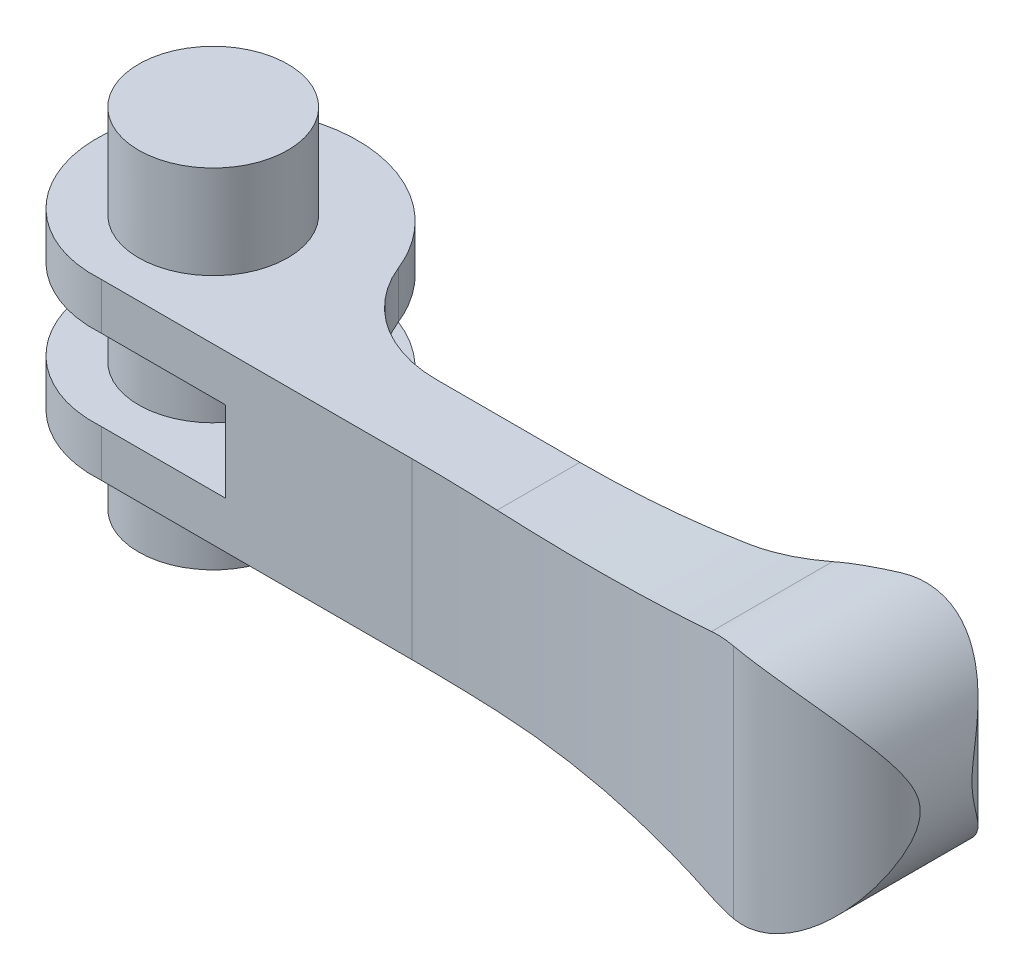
ISO-10303-21;
HEADER;
FILE_DESCRIPTION(('STEP AP214'),'2;1');
FILE_NAME('part.step','',(''),(''),'','','');
FILE_SCHEMA(('AUTOMOTIVE_DESIGN { 1 0 10303 214 1 1 1 1 }'));
ENDSEC;
DATA;
#1=APPLICATION_CONTEXT('core data for automotive mechanical design processes');
#2=APPLICATION_PROTOCOL_DEFINITION('international standard','automotive_design',2000,#1);
#3=PRODUCT_CONTEXT('',#1,'mechanical');
#4=PRODUCT('Part','Part','',(#3));
#5=PRODUCT_RELATED_PRODUCT_CATEGORY('part','',(#4));
#6=PRODUCT_DEFINITION_FORMATION('','',#4);
#7=PRODUCT_DEFINITION_CONTEXT('part definition',#1,'design');
#8=PRODUCT_DEFINITION('design','',#6,#7);
#9=PRODUCT_DEFINITION_SHAPE('','',#8);
#10=(LENGTH_UNIT() NAMED_UNIT(*) SI_UNIT(.MILLI.,.METRE.));
#11=(NAMED_UNIT(*) PLANE_ANGLE_UNIT() SI_UNIT($,.RADIAN.));
#12=(NAMED_UNIT(*) SI_UNIT($,.STERADIAN.) SOLID_ANGLE_UNIT());
#13=UNCERTAINTY_MEASURE_WITH_UNIT(LENGTH_MEASURE(1.E-05),#10,'distance_accuracy_value','');
#14=(GEOMETRIC_REPRESENTATION_CONTEXT(3) GLOBAL_UNCERTAINTY_ASSIGNED_CONTEXT((#13)) GLOBAL_UNIT_ASSIGNED_CONTEXT((#10,
#11,#12)) REPRESENTATION_CONTEXT('',''));
#15=CARTESIAN_POINT('',(0.,0.,0.));
#16=DIRECTION('',(0.,0.,1.));
#17=DIRECTION('',(1.,0.,0.));
#18=AXIS2_PLACEMENT_3D('',#15,#16,#17);
#19=CARTESIAN_POINT('',(25.,-9.5,165.511363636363));
#20=DIRECTION('',(0.,1.,0.));
#21=DIRECTION('',(1.,0.,0.));
#22=AXIS2_PLACEMENT_3D('',#19,#20,#21);
#23=CYLINDRICAL_SURFACE('',#22,156.511363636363);
#24=CARTESIAN_POINT('',(51.3201707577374,9.24653148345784,11.2289746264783));
#25=CARTESIAN_POINT('',(51.4954696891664,9.2878649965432,11.258877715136));
#26=CARTESIAN_POINT('',(51.6718456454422,9.32417702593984,11.2892762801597));
#27=CARTESIAN_POINT('',(52.0256660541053,9.38661054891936,11.3508882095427));
#28=CARTESIAN_POINT('',(52.203105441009,9.41276355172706,11.3820987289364));
#29=CARTESIAN_POINT('',(52.7374701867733,9.476153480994,11.4770445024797));
#30=CARTESIAN_POINT('',(53.0960294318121,9.49822441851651,11.5420236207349));
#31=CARTESIAN_POINT('',(53.4546518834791,9.49989176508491,11.608343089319));
#32=B_SPLINE_CURVE_WITH_KNOTS('',3,(#24,#25,#26,#27,#28,#29,#30,#31),.UNSPECIFIED.,.F.,.F.,(4,2,
2,4),(0.,0.547600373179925,1.0934884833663,2.18654613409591),.UNSPECIFIED.);
#33=CARTESIAN_POINT('',(51.3201707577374,9.24653148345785,11.2289746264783));
#34=VERTEX_POINT('',#33);
#35=CARTESIAN_POINT('',(53.4546518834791,9.49989176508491,11.6083430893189));
#36=VERTEX_POINT('',#35);
#37=EDGE_CURVE('E177',#34,#36,#32,.T.);
#38=ORIENTED_EDGE('',*,*,#37,.F.);
#39=CARTESIAN_POINT('',(32.,7.,9.15661651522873));
#40=CARTESIAN_POINT('',(32.8182704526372,6.99999719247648,9.19324583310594));
#41=CARTESIAN_POINT('',(33.6361960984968,7.01192923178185,9.23630636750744));
#42=CARTESIAN_POINT('',(35.2705716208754,7.05957160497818,9.33520563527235));
#43=CARTESIAN_POINT('',(36.0870215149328,7.09528165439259,9.39104421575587));
#44=CARTESIAN_POINT('',(38.5259507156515,7.23753055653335,9.57706397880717));
#45=CARTESIAN_POINT('',(40.1451052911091,7.37919060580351,9.72606814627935));
#46=CARTESIAN_POINT('',(43.3672677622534,7.75507082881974,10.0730278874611));
#47=CARTESIAN_POINT('',(44.9702760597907,7.98928869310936,10.2709822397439));
#48=CARTESIAN_POINT('',(47.3611114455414,8.40908803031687,10.6035220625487));
#49=CARTESIAN_POINT('',(48.1574841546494,8.56083603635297,10.7205953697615));
#50=CARTESIAN_POINT('',(49.7438041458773,8.88685979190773,10.9662394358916));
#51=CARTESIAN_POINT('',(50.5337515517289,9.06113510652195,11.0948099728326));
#52=CARTESIAN_POINT('',(51.3201707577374,9.24653148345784,11.2289746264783));
#53=B_SPLINE_CURVE_WITH_KNOTS('',3,(#39,#40,#41,#42,#43,#44,#45,#46,#47,#48,#49,#50,#51,#52),
.UNSPECIFIED.,.F.,.F.,(4,2,2,2,2,2,4),(0.,2.45704528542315,4.91406117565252,9.80682643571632,
14.699469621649,17.1564399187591,19.6133627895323),.UNSPECIFIED.);
#54=CARTESIAN_POINT('',(32.,7.,9.15661651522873));
#55=VERTEX_POINT('',#54);
#56=EDGE_CURVE('E145',#55,#34,#53,.T.);
#57=ORIENTED_EDGE('',*,*,#56,.F.);
#58=CARTESIAN_POINT('',(25.,7.,165.511363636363));
#59=DIRECTION('',(0.,1.,0.));
#60=DIRECTION('',(1.,0.,0.));
#61=AXIS2_PLACEMENT_3D('',#58,#59,#60);
#62=CIRCLE('',#61,156.511363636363);
#63=CARTESIAN_POINT('',(25.,7.,9.));
#64=VERTEX_POINT('',#63);
#65=EDGE_CURVE('E154',#64,#55,#62,.F.);
#66=ORIENTED_EDGE('',*,*,#65,.F.);
#67=DIRECTION('',(0.,1.,0.));
#68=VECTOR('',#67,1.);
#69=CARTESIAN_POINT('',(25.,-9.5,9.));
#70=LINE('',#69,#68);
#71=CARTESIAN_POINT('',(25.,-7.,9.));
#72=VERTEX_POINT('',#71);
#73=EDGE_CURVE('E303',#72,#64,#70,.T.);
#74=ORIENTED_EDGE('',*,*,#73,.F.);
#75=CARTESIAN_POINT('',(25.,-7.,165.511363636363));
#76=DIRECTION('',(0.,1.,0.));
#77=DIRECTION('',(1.,0.,0.));
#78=AXIS2_PLACEMENT_3D('',#75,#76,#77);
#79=CIRCLE('',#78,156.511363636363);
#80=CARTESIAN_POINT('',(32.,-7.,9.15661651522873));
#81=VERTEX_POINT('',#80);
#82=EDGE_CURVE('E511',#72,#81,#79,.F.);
#83=ORIENTED_EDGE('',*,*,#82,.T.);
#84=CARTESIAN_POINT('',(32.,-7.,9.15661651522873));
#85=CARTESIAN_POINT('',(32.8182704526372,-6.99999719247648,9.19324583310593));
#86=CARTESIAN_POINT('',(33.6361960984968,-7.01192923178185,9.23630636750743));
#87=CARTESIAN_POINT('',(35.2705716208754,-7.05957160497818,9.33520563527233));
#88=CARTESIAN_POINT('',(36.0870215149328,-7.09528165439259,9.39104421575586));
#89=CARTESIAN_POINT('',(38.5259507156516,-7.23753055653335,9.57706397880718));
#90=CARTESIAN_POINT('',(40.1451052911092,-7.37919060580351,9.72606814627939));
#91=CARTESIAN_POINT('',(43.3672677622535,-7.75507082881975,10.0730278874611));
#92=CARTESIAN_POINT('',(44.9702760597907,-7.98928869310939,10.2709822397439));
#93=CARTESIAN_POINT('',(47.3611114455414,-8.40908803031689,10.6035220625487));
#94=CARTESIAN_POINT('',(48.1574841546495,-8.56083603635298,10.7205953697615));
#95=CARTESIAN_POINT('',(49.7438041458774,-8.88685979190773,10.9662394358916));
#96=CARTESIAN_POINT('',(50.533751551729,-9.06113510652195,11.0948099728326));
#97=CARTESIAN_POINT('',(51.3201707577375,-9.24653148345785,11.2289746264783));
#98=B_SPLINE_CURVE_WITH_KNOTS('',3,(#84,#85,#86,#87,#88,#89,#90,#91,#92,#93,#94,#95,#96,#97),
.UNSPECIFIED.,.F.,.F.,(4,2,2,2,2,2,4),(0.,2.45704528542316,4.91406117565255,9.80682643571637,
14.699469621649,17.1564399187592,19.6133627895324),.UNSPECIFIED.);
#99=CARTESIAN_POINT('',(51.3201707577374,-9.24653148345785,11.2289746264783));
#100=VERTEX_POINT('',#99);
#101=EDGE_CURVE('E512',#81,#100,#98,.T.);
#102=ORIENTED_EDGE('',*,*,#101,.T.);
#103=CARTESIAN_POINT('',(51.3201707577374,-9.24653148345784,11.2289746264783));
#104=CARTESIAN_POINT('',(51.4954696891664,-9.2878649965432,11.258877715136));
#105=CARTESIAN_POINT('',(51.6718456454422,-9.32417702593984,11.2892762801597));
#106=CARTESIAN_POINT('',(52.0256660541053,-9.38661054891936,11.3508882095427));
#107=CARTESIAN_POINT('',(52.203105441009,-9.41276355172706,11.3820987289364));
#108=CARTESIAN_POINT('',(52.7374701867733,-9.476153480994,11.4770445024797));
#109=CARTESIAN_POINT('',(53.0960294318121,-9.49822441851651,11.5420236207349));
#110=CARTESIAN_POINT('',(53.4546518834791,-9.49989176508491,11.608343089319));
#111=B_SPLINE_CURVE_WITH_KNOTS('',3,(#103,#104,#105,#106,#107,#108,#109,#110),.UNSPECIFIED.,.F.,
.F.,(4,2,2,4),(0.,0.547600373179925,1.0934884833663,2.18654613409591),.UNSPECIFIED.);
#112=CARTESIAN_POINT('',(53.4546518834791,-9.49989176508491,11.6083430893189));
#113=VERTEX_POINT('',#112);
#114=EDGE_CURVE('E223',#100,#113,#111,.T.);
#115=ORIENTED_EDGE('',*,*,#114,.T.);
#116=DIRECTION('',(0.,1.,0.));
#117=VECTOR('',#116,1.);
#118=CARTESIAN_POINT('',(53.4546518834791,-9.5,11.6083430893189));
#119=LINE('',#118,#117);
#120=EDGE_CURVE('E286',#113,#36,#119,.T.);
#121=ORIENTED_EDGE('',*,*,#120,.T.);
#122=EDGE_LOOP('',(#38,#57,#66,#74,#83,#102,#115,#121));
#123=FACE_BOUND('',#122,.T.);
#124=ADVANCED_FACE('F14',(#123),#23,.F.);
#125=CARTESIAN_POINT('',(0.,-9.5,9.));
#126=DIRECTION('',(0.,0.,-1.));
#127=DIRECTION('',(1.,0.,0.));
#128=AXIS2_PLACEMENT_3D('',#125,#126,#127);
#129=PLANE('',#128);
#130=DIRECTION('',(1.,0.,0.));
#131=VECTOR('',#130,1.);
#132=CARTESIAN_POINT('',(0.,7.,9.));
#133=LINE('',#132,#131);
#134=CARTESIAN_POINT('',(0.,7.,9.));
#135=VERTEX_POINT('',#134);
#136=EDGE_CURVE('E165',#135,#64,#133,.T.);
#137=ORIENTED_EDGE('',*,*,#136,.F.);
#138=DIRECTION('',(0.,1.,0.));
#139=VECTOR('',#138,1.);
#140=CARTESIAN_POINT('',(0.,-9.5,9.));
#141=LINE('',#140,#139);
#142=CARTESIAN_POINT('',(0.,3.25,9.));
#143=VERTEX_POINT('',#142);
#144=EDGE_CURVE('E294',#143,#135,#141,.T.);
#145=ORIENTED_EDGE('',*,*,#144,.F.);
#146=DIRECTION('',(1.,0.,0.));
#147=VECTOR('',#146,1.);
#148=CARTESIAN_POINT('',(0.,3.25,9.));
#149=LINE('',#148,#147);
#150=CARTESIAN_POINT('',(10.,3.25,9.));
#151=VERTEX_POINT('',#150);
#152=EDGE_CURVE('E42',#143,#151,#149,.T.);
#153=ORIENTED_EDGE('',*,*,#152,.T.);
#154=DIRECTION('',(0.,-1.,0.));
#155=VECTOR('',#154,1.);
#156=CARTESIAN_POINT('',(10.,-9.5,9.));
#157=LINE('',#156,#155);
#158=CARTESIAN_POINT('',(10.,-3.25,9.));
#159=VERTEX_POINT('',#158);
#160=EDGE_CURVE('E367',#151,#159,#157,.T.);
#161=ORIENTED_EDGE('',*,*,#160,.T.);
#162=DIRECTION('',(-1.,0.,0.));
#163=VECTOR('',#162,1.);
#164=CARTESIAN_POINT('',(0.,-3.25,9.));
#165=LINE('',#164,#163);
#166=CARTESIAN_POINT('',(0.,-3.25,9.));
#167=VERTEX_POINT('',#166);
#168=EDGE_CURVE('E361',#159,#167,#165,.T.);
#169=ORIENTED_EDGE('',*,*,#168,.T.);
#170=CARTESIAN_POINT('',(0.,-7.,9.));
#171=VERTEX_POINT('',#170);
#172=EDGE_CURVE('E298',#171,#167,#141,.T.);
#173=ORIENTED_EDGE('',*,*,#172,.F.);
#174=DIRECTION('',(1.,0.,0.));
#175=VECTOR('',#174,1.);
#176=CARTESIAN_POINT('',(0.,-7.,9.));
#177=LINE('',#176,#175);
#178=EDGE_CURVE('E514',#171,#72,#177,.T.);
#179=ORIENTED_EDGE('',*,*,#178,.T.);
#180=ORIENTED_EDGE('',*,*,#73,.T.);
#181=EDGE_LOOP('',(#137,#145,#153,#161,#169,#173,#179,#180));
#182=FACE_BOUND('',#181,.T.);
#183=ADVANCED_FACE('F274',(#182),#129,.F.);
#184=CARTESIAN_POINT('',(0.,-9.5,9.));
#185=CARTESIAN_POINT('',(-1.17809724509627,-9.5,9.082375));
#186=CARTESIAN_POINT('',(-2.38889185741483,-9.5,8.93034251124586));
#187=CARTESIAN_POINT('',(-4.68855121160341,-9.5,8.15611653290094));
#188=CARTESIAN_POINT('',(-5.77641227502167,-9.5,7.53398899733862));
#189=CARTESIAN_POINT('',(-7.65048483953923,-9.5,5.892908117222));
#190=CARTESIAN_POINT('',(-8.43577630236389,-9.5,4.87441779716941));
#191=CARTESIAN_POINT('',(-9.56393765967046,-9.5,2.58130784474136));
#192=CARTESIAN_POINT('',(-9.906125,-9.5,1.3074915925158));
#193=CARTESIAN_POINT('',(-10.070875,-9.5,-1.30749159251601));
#194=CARTESIAN_POINT('',(-9.89311450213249,-9.5,-2.64762964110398));
#195=CARTESIAN_POINT('',(-9.01985437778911,-9.5,-5.18637857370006));
#196=CARTESIAN_POINT('',(-8.32445967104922,-9.5,-6.38389170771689));
#197=CARTESIAN_POINT('',(-6.50038754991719,-9.5,-8.44095551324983));
#198=CARTESIAN_POINT('',(-5.37224515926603,-9.5,-9.29951414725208));
#199=CARTESIAN_POINT('',(-2.8400456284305,-9.5,-10.5267096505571));
#200=CARTESIAN_POINT('',(-1.43688593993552,-9.5,-10.894625));
#201=CARTESIAN_POINT('',(1.43688593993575,-9.5,-11.059375));
#202=CARTESIAN_POINT('',(2.90636742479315,-9.5,-10.8558864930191));
#203=CARTESIAN_POINT('',(5.6842059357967,-9.5,-9.88359222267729));
#204=CARTESIAN_POINT('',(6.9913711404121,-9.5,-9.11493034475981));
#205=CARTESIAN_POINT('',(9.23142618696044,-9.5,-7.10786698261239));
#206=CARTESIAN_POINT('',(10.1632519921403,-9.5,-5.87007252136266));
#207=CARTESIAN_POINT('',(11.4894816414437,-9.5,-3.09878341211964));
#208=CARTESIAN_POINT('',(11.883125,-9.5,-1.56628028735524));
#209=CARTESIAN_POINT('',(12.047875,-9.5,1.56628028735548));
#210=CARTESIAN_POINT('',(11.8186584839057,-9.5,3.16510520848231));
#211=CARTESIAN_POINT('',(10.7473300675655,-9.5,6.18203329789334));
#212=CARTESIAN_POINT('',(9.9054010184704,-9.5,7.59885057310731));
#213=CARTESIAN_POINT('',(7.71534641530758,-9.5,10.021896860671));
#214=CARTESIAN_POINT('',(6.36789988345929,-9.5,11.0269898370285));
#215=CARTESIAN_POINT('',(3.35752119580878,-9.5,12.4522536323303));
#216=CARTESIAN_POINT('',(1.69567463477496,-9.5,12.871625));
#217=CARTESIAN_POINT('',(-1.32513132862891E-13,-9.5,12.954));
#218=B_SPLINE_CURVE_WITH_KNOTS('',3,(#184,#185,#186,#187,#188,#189,#190,#191,#192,#193,#194,
#195,#196,#197,#198,#199,#200,#201,#202,#203,#204,#205,#206,#207,#208,#209,#210,#211,#212,#213,
#214,#215,#216,#217),.UNSPECIFIED.,.F.,.F.,(4,2,2,2,2,2,2,2,2,2,2,2,2,2,2,2,4),(0.,0.0625,0.125,
0.1875,0.25,0.3125,0.375,0.4375,0.5,0.5625,0.625,0.6875,0.75,0.8125,0.875,0.9375,1.),.UNSPECIFIED.);
#219=DIRECTION('',(0.,1.,0.));
#220=VECTOR('',#219,1.);
#221=SURFACE_OF_LINEAR_EXTRUSION('',#218,#220);
#222=CARTESIAN_POINT('',(0.,7.,9.));
#223=CARTESIAN_POINT('',(-1.17809724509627,7.,9.082375));
#224=CARTESIAN_POINT('',(-2.38889185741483,7.,8.93034251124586));
#225=CARTESIAN_POINT('',(-4.68855121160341,7.,8.15611653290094));
#226=CARTESIAN_POINT('',(-5.77641227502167,7.,7.53398899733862));
#227=CARTESIAN_POINT('',(-7.65048483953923,7.,5.892908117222));
#228=CARTESIAN_POINT('',(-8.43577630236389,7.,4.87441779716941));
#229=CARTESIAN_POINT('',(-9.56393765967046,7.,2.58130784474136));
#230=CARTESIAN_POINT('',(-9.906125,7.,1.3074915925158));
#231=CARTESIAN_POINT('',(-10.070875,7.,-1.30749159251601));
#232=CARTESIAN_POINT('',(-9.89311450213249,7.,-2.64762964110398));
#233=CARTESIAN_POINT('',(-9.01985437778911,7.,-5.18637857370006));
#234=CARTESIAN_POINT('',(-8.32445967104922,7.,-6.38389170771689));
#235=CARTESIAN_POINT('',(-6.50038754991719,7.,-8.44095551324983));
#236=CARTESIAN_POINT('',(-5.37224515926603,7.,-9.29951414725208));
#237=CARTESIAN_POINT('',(-2.8400456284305,7.,-10.5267096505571));
#238=CARTESIAN_POINT('',(-1.43688593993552,7.,-10.894625));
#239=CARTESIAN_POINT('',(1.43688593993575,7.,-11.059375));
#240=CARTESIAN_POINT('',(2.90636742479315,7.,-10.8558864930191));
#241=CARTESIAN_POINT('',(5.6842059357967,7.,-9.88359222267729));
#242=CARTESIAN_POINT('',(6.9913711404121,7.,-9.11493034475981));
#243=CARTESIAN_POINT('',(9.23142618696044,7.,-7.10786698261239));
#244=CARTESIAN_POINT('',(10.1632519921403,7.,-5.87007252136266));
#245=CARTESIAN_POINT('',(11.4894816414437,7.,-3.09878341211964));
#246=CARTESIAN_POINT('',(11.883125,7.,-1.56628028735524));
#247=CARTESIAN_POINT('',(12.047875,7.,1.56628028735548));
#248=CARTESIAN_POINT('',(11.8186584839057,7.,3.16510520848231));
#249=CARTESIAN_POINT('',(10.7473300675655,7.,6.18203329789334));
#250=CARTESIAN_POINT('',(9.9054010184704,7.,7.59885057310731));
#251=CARTESIAN_POINT('',(7.71534641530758,7.,10.021896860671));
#252=CARTESIAN_POINT('',(6.36789988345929,7.,11.0269898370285));
#253=CARTESIAN_POINT('',(3.35752119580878,7.,12.4522536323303));
#254=CARTESIAN_POINT('',(1.69567463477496,7.,12.871625));
#255=CARTESIAN_POINT('',(-1.32513132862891E-13,7.,12.954));
#256=B_SPLINE_CURVE_WITH_KNOTS('',3,(#222,#223,#224,#225,#226,#227,#228,#229,#230,#231,#232,
#233,#234,#235,#236,#237,#238,#239,#240,#241,#242,#243,#244,#245,#246,#247,#248,#249,#250,#251,
#252,#253,#254,#255),.UNSPECIFIED.,.F.,.F.,(4,2,2,2,2,2,2,2,2,2,2,2,2,2,2,2,4),(0.,0.0625,0.125,
0.1875,0.25,0.3125,0.375,0.4375,0.5,0.5625,0.625,0.6875,0.75,0.8125,0.875,0.9375,1.),.UNSPECIFIED.);
#257=CARTESIAN_POINT('',(11.1333903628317,7.,-3.78460278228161));
#258=VERTEX_POINT('',#257);
#259=EDGE_CURVE('E163',#258,#135,#256,.F.);
#260=ORIENTED_EDGE('',*,*,#259,.F.);
#261=DIRECTION('',(0.,1.,0.));
#262=VECTOR('',#261,1.);
#263=CARTESIAN_POINT('',(11.1333903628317,9.5,-3.78460278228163));
#264=LINE('',#263,#262);
#265=CARTESIAN_POINT('',(11.1333903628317,3.25,-3.78460278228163));
#266=VERTEX_POINT('',#265);
#267=EDGE_CURVE('E35',#258,#266,#264,.F.);
#268=ORIENTED_EDGE('',*,*,#267,.T.);
#269=CARTESIAN_POINT('',(0.,3.25,9.));
#270=CARTESIAN_POINT('',(-1.17809724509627,3.25,9.082375));
#271=CARTESIAN_POINT('',(-2.38889185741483,3.25,8.93034251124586));
#272=CARTESIAN_POINT('',(-4.68855121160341,3.25,8.15611653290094));
#273=CARTESIAN_POINT('',(-5.77641227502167,3.25,7.53398899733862));
#274=CARTESIAN_POINT('',(-7.65048483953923,3.25,5.892908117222));
#275=CARTESIAN_POINT('',(-8.43577630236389,3.25,4.87441779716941));
#276=CARTESIAN_POINT('',(-9.56393765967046,3.25,2.58130784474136));
#277=CARTESIAN_POINT('',(-9.906125,3.25,1.3074915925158));
#278=CARTESIAN_POINT('',(-10.070875,3.25,-1.30749159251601));
#279=CARTESIAN_POINT('',(-9.89311450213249,3.25,-2.64762964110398));
#280=CARTESIAN_POINT('',(-9.01985437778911,3.25,-5.18637857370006));
#281=CARTESIAN_POINT('',(-8.32445967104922,3.25,-6.38389170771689));
#282=CARTESIAN_POINT('',(-6.50038754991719,3.25,-8.44095551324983));
#283=CARTESIAN_POINT('',(-5.37224515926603,3.25,-9.29951414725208));
#284=CARTESIAN_POINT('',(-2.8400456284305,3.25,-10.5267096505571));
#285=CARTESIAN_POINT('',(-1.43688593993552,3.25,-10.894625));
#286=CARTESIAN_POINT('',(1.43688593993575,3.25,-11.059375));
#287=CARTESIAN_POINT('',(2.90636742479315,3.25,-10.8558864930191));
#288=CARTESIAN_POINT('',(5.6842059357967,3.25,-9.88359222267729));
#289=CARTESIAN_POINT('',(6.9913711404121,3.25,-9.11493034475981));
#290=CARTESIAN_POINT('',(9.23142618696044,3.25,-7.10786698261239));
#291=CARTESIAN_POINT('',(10.1632519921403,3.25,-5.87007252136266));
#292=CARTESIAN_POINT('',(11.4894816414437,3.25,-3.09878341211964));
#293=CARTESIAN_POINT('',(11.883125,3.25,-1.56628028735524));
#294=CARTESIAN_POINT('',(12.047875,3.25,1.56628028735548));
#295=CARTESIAN_POINT('',(11.8186584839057,3.25,3.16510520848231));
#296=CARTESIAN_POINT('',(10.7473300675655,3.25,6.18203329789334));
#297=CARTESIAN_POINT('',(9.9054010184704,3.25,7.59885057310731));
#298=CARTESIAN_POINT('',(7.71534641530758,3.25,10.021896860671));
#299=CARTESIAN_POINT('',(6.36789988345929,3.25,11.0269898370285));
#300=CARTESIAN_POINT('',(3.35752119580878,3.25,12.4522536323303));
#301=CARTESIAN_POINT('',(1.69567463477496,3.25,12.871625));
#302=CARTESIAN_POINT('',(-1.32513132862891E-13,3.25,12.954));
#303=B_SPLINE_CURVE_WITH_KNOTS('',3,(#269,#270,#271,#272,#273,#274,#275,#276,#277,#278,#279,
#280,#281,#282,#283,#284,#285,#286,#287,#288,#289,#290,#291,#292,#293,#294,#295,#296,#297,#298,
#299,#300,#301,#302),.UNSPECIFIED.,.F.,.F.,(4,2,2,2,2,2,2,2,2,2,2,2,2,2,2,2,4),(0.,0.0625,0.125,
0.1875,0.25,0.3125,0.375,0.4375,0.5,0.5625,0.625,0.6875,0.75,0.8125,0.875,0.9375,1.),.UNSPECIFIED.);
#304=EDGE_CURVE('E309',#266,#143,#303,.F.);
#305=ORIENTED_EDGE('',*,*,#304,.T.);
#306=ORIENTED_EDGE('',*,*,#144,.T.);
#307=EDGE_LOOP('',(#260,#268,#305,#306));
#308=FACE_BOUND('',#307,.T.);
#309=ADVANCED_FACE('F280',(#308),#221,.F.);
#310=CARTESIAN_POINT('',(11.8345872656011,-9.5,2.5));
#311=DIRECTION('',(0.,0.,1.));
#312=DIRECTION('',(-1.,0.,0.));
#313=AXIS2_PLACEMENT_3D('',#310,#311,#312);
#314=PLANE('',#313);
#315=CARTESIAN_POINT('',(32.,91.2,2.5));
#316=DIRECTION('',(0.,0.,1.));
#317=DIRECTION('',(-1.,0.,0.));
#318=AXIS2_PLACEMENT_3D('',#315,#316,#317);
#319=CIRCLE('',#318,84.2);
#320=CARTESIAN_POINT('',(45.5626570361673,8.09949257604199,2.5));
#321=VERTEX_POINT('',#320);
#322=CARTESIAN_POINT('',(32.,7.,2.5));
#323=VERTEX_POINT('',#322);
#324=EDGE_CURVE('E134',#321,#323,#319,.F.);
#325=ORIENTED_EDGE('',*,*,#324,.F.);
#326=DIRECTION('',(0.,1.,0.));
#327=VECTOR('',#326,1.);
#328=CARTESIAN_POINT('',(45.5626570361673,-9.5,2.5));
#329=LINE('',#328,#327);
#330=CARTESIAN_POINT('',(45.5626570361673,-8.09949257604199,2.5));
#331=VERTEX_POINT('',#330);
#332=EDGE_CURVE('E290',#331,#321,#329,.T.);
#333=ORIENTED_EDGE('',*,*,#332,.F.);
#334=CARTESIAN_POINT('',(32.,-91.2,2.5));
#335=DIRECTION('',(0.,0.,1.));
#336=DIRECTION('',(-1.,0.,0.));
#337=AXIS2_PLACEMENT_3D('',#334,#335,#336);
#338=CIRCLE('',#337,84.2);
#339=CARTESIAN_POINT('',(32.,-7.,2.5));
#340=VERTEX_POINT('',#339);
#341=EDGE_CURVE('E258',#331,#340,#338,.T.);
#342=ORIENTED_EDGE('',*,*,#341,.T.);
#343=DIRECTION('',(-1.,0.,0.));
#344=VECTOR('',#343,1.);
#345=CARTESIAN_POINT('',(11.8345872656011,-7.,2.5));
#346=LINE('',#345,#344);
#347=CARTESIAN_POINT('',(20.417560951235,-7.,2.5));
#348=VERTEX_POINT('',#347);
#349=EDGE_CURVE('E330',#340,#348,#346,.T.);
#350=ORIENTED_EDGE('',*,*,#349,.T.);
#351=DIRECTION('',(0.,-1.,0.));
#352=VECTOR('',#351,1.);
#353=CARTESIAN_POINT('',(20.417560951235,9.5,2.5));
#354=LINE('',#353,#352);
#355=CARTESIAN_POINT('',(20.417560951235,-3.25,2.5));
#356=VERTEX_POINT('',#355);
#357=EDGE_CURVE('E315',#348,#356,#354,.F.);
#358=ORIENTED_EDGE('',*,*,#357,.T.);
#359=DIRECTION('',(-1.,0.,0.));
#360=VECTOR('',#359,1.);
#361=CARTESIAN_POINT('',(28.,-3.25,2.5));
#362=LINE('',#361,#360);
#363=CARTESIAN_POINT('',(10.,-3.25,2.5));
#364=VERTEX_POINT('',#363);
#365=EDGE_CURVE('E341',#356,#364,#362,.T.);
#366=ORIENTED_EDGE('',*,*,#365,.T.);
#367=DIRECTION('',(0.,1.,0.));
#368=VECTOR('',#367,1.);
#369=CARTESIAN_POINT('',(10.,-3.25,2.5));
#370=LINE('',#369,#368);
#371=CARTESIAN_POINT('',(10.,3.25,2.5));
#372=VERTEX_POINT('',#371);
#373=EDGE_CURVE('E339',#364,#372,#370,.T.);
#374=ORIENTED_EDGE('',*,*,#373,.T.);
#375=DIRECTION('',(-1.,0.,0.));
#376=VECTOR('',#375,1.);
#377=CARTESIAN_POINT('',(28.,3.25,2.5));
#378=LINE('',#377,#376);
#379=CARTESIAN_POINT('',(20.417560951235,3.25,2.5));
#380=VERTEX_POINT('',#379);
#381=EDGE_CURVE('E336',#380,#372,#378,.T.);
#382=ORIENTED_EDGE('',*,*,#381,.F.);
#383=CARTESIAN_POINT('',(20.417560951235,7.,2.50000000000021));
#384=VERTEX_POINT('',#383);
#385=EDGE_CURVE('E162',#380,#384,#354,.F.);
#386=ORIENTED_EDGE('',*,*,#385,.T.);
#387=DIRECTION('',(-1.,0.,0.));
#388=VECTOR('',#387,1.);
#389=CARTESIAN_POINT('',(11.8345872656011,7.,2.5));
#390=LINE('',#389,#388);
#391=EDGE_CURVE('E151',#323,#384,#390,.T.);
#392=ORIENTED_EDGE('',*,*,#391,.F.);
#393=EDGE_LOOP('',(#325,#333,#342,#350,#358,#366,#374,#382,#386,#392));
#394=FACE_BOUND('',#393,.T.);
#395=ADVANCED_FACE('F159',(#394),#314,.F.);
#396=CARTESIAN_POINT('',(45.5626570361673,-9.5,-14.5));
#397=DIRECTION('',(0.,1.,0.));
#398=DIRECTION('',(1.,0.,0.));
#399=AXIS2_PLACEMENT_3D('',#396,#397,#398);
#400=CYLINDRICAL_SURFACE('',#399,17.);
#401=CARTESIAN_POINT('',(54.9597606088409,9.38717736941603,-0.333333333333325));
#402=CARTESIAN_POINT('',(54.7316206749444,9.42267662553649,-0.181950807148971));
#403=CARTESIAN_POINT('',(54.498837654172,9.45033434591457,-0.0355271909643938));
#404=CARTESIAN_POINT('',(54.0250539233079,9.48845532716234,0.246646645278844));
#405=CARTESIAN_POINT('',(53.7840411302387,9.49889208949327,0.382380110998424));
#406=CARTESIAN_POINT('',(53.3000815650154,9.5009221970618,0.639552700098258));
#407=CARTESIAN_POINT('',(53.0572524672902,9.49285956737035,0.761209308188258));
#408=CARTESIAN_POINT('',(52.5674007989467,9.45729667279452,0.992150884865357));
#409=CARTESIAN_POINT('',(52.3203826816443,9.42981592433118,1.10144814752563));
#410=CARTESIAN_POINT('',(51.9475951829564,9.37315159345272,1.2559775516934));
#411=CARTESIAN_POINT('',(51.8226148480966,9.35161024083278,1.306040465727));
#412=CARTESIAN_POINT('',(51.5718111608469,9.30314348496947,1.40308902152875));
#413=CARTESIAN_POINT('',(51.4459865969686,9.27619341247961,1.45005920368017));
#414=CARTESIAN_POINT('',(51.3201707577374,9.24653148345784,1.49534418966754));
#415=B_SPLINE_CURVE_WITH_KNOTS('',3,(#401,#402,#403,#404,#405,#406,#407,#408,#409,#410,#411,
#412,#413,#414),.UNSPECIFIED.,.F.,.F.,(4,2,2,2,2,2,4),(0.,0.828239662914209,1.65775258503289,
2.47196473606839,3.28535971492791,3.6942751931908,4.10509995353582),.UNSPECIFIED.);
#416=CARTESIAN_POINT('',(54.9597606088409,9.38717736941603,-0.333333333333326));
#417=VERTEX_POINT('',#416);
#418=CARTESIAN_POINT('',(51.3201707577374,9.24653148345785,1.49534418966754));
#419=VERTEX_POINT('',#418);
#420=EDGE_CURVE('E146',#417,#419,#415,.T.);
#421=ORIENTED_EDGE('',*,*,#420,.F.);
#422=DIRECTION('',(0.,1.,0.));
#423=VECTOR('',#422,1.);
#424=CARTESIAN_POINT('',(54.9597606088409,-9.5,-0.333333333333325));
#425=LINE('',#424,#423);
#426=CARTESIAN_POINT('',(54.9597606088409,-9.38717736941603,-0.333333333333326));
#427=VERTEX_POINT('',#426);
#428=EDGE_CURVE('E295',#427,#417,#425,.T.);
#429=ORIENTED_EDGE('',*,*,#428,.F.);
#430=CARTESIAN_POINT('',(54.9597606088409,-9.38717736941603,-0.333333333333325));
#431=CARTESIAN_POINT('',(54.7316206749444,-9.42267662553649,-0.181950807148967));
#432=CARTESIAN_POINT('',(54.498837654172,-9.45033434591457,-0.0355271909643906));
#433=CARTESIAN_POINT('',(54.0250539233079,-9.48845532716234,0.246646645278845));
#434=CARTESIAN_POINT('',(53.7840411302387,-9.49889208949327,0.382380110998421));
#435=CARTESIAN_POINT('',(53.3000815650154,-9.5009221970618,0.639552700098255));
#436=CARTESIAN_POINT('',(53.0572524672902,-9.49285956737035,0.761209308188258));
#437=CARTESIAN_POINT('',(52.5674007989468,-9.45729667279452,0.992150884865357));
#438=CARTESIAN_POINT('',(52.3203826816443,-9.42981592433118,1.10144814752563));
#439=CARTESIAN_POINT('',(51.9475951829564,-9.37315159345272,1.2559775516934));
#440=CARTESIAN_POINT('',(51.8226148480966,-9.35161024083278,1.306040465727));
#441=CARTESIAN_POINT('',(51.5718111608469,-9.30314348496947,1.40308902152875));
#442=CARTESIAN_POINT('',(51.4459865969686,-9.27619341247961,1.45005920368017));
#443=CARTESIAN_POINT('',(51.3201707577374,-9.24653148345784,1.49534418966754));
#444=B_SPLINE_CURVE_WITH_KNOTS('',3,(#430,#431,#432,#433,#434,#435,#436,#437,#438,#439,#440,
#441,#442,#443),.UNSPECIFIED.,.F.,.F.,(4,2,2,2,2,2,4),(0.,0.82823966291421,1.65775258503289,
2.47196473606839,3.28535971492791,3.6942751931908,4.10509995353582),.UNSPECIFIED.);
#445=CARTESIAN_POINT('',(51.3201707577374,-9.24653148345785,1.49534418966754));
#446=VERTEX_POINT('',#445);
#447=EDGE_CURVE('E224',#427,#446,#444,.T.);
#448=ORIENTED_EDGE('',*,*,#447,.T.);
#449=CARTESIAN_POINT('',(51.3201707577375,-9.24653148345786,1.49534418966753));
#450=CARTESIAN_POINT('',(50.8603357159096,-9.13808848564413,1.66090351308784));
#451=CARTESIAN_POINT('',(50.3928479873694,-9.03200341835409,1.80673339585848));
#452=CARTESIAN_POINT('',(49.4492987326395,-8.82651076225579,2.05687636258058));
#453=CARTESIAN_POINT('',(48.9733251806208,-8.72705992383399,2.16148595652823));
#454=CARTESIAN_POINT('',(48.0126814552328,-8.53516921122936,2.32959170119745));
#455=CARTESIAN_POINT('',(47.5280109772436,-8.44272958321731,2.39308640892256));
#456=CARTESIAN_POINT('',(46.7955018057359,-8.30973871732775,2.45702873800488));
#457=CARTESIAN_POINT('',(46.5494786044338,-8.26620019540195,2.4731270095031));
#458=CARTESIAN_POINT('',(46.0565939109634,-8.18123846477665,2.49461289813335));
#459=CARTESIAN_POINT('',(45.8097323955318,-8.13981531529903,2.500000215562));
#460=CARTESIAN_POINT('',(45.5626570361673,-8.09949257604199,2.5));
#461=B_SPLINE_CURVE_WITH_KNOTS('',3,(#449,#450,#451,#452,#453,#454,#455,#456,#457,#458,#459,
#460),.UNSPECIFIED.,.F.,.F.,(4,2,2,2,2,4),(0.,1.5013779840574,2.99174983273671,4.48217398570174,
5.23305850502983,5.98396403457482),.UNSPECIFIED.);
#462=EDGE_CURVE('E292',#446,#331,#461,.T.);
#463=ORIENTED_EDGE('',*,*,#462,.T.);
#464=ORIENTED_EDGE('',*,*,#332,.T.);
#465=CARTESIAN_POINT('',(51.3201707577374,9.24653148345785,1.49534418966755));
#466=CARTESIAN_POINT('',(50.8603357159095,9.13808848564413,1.66090351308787));
#467=CARTESIAN_POINT('',(50.3928479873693,9.03200341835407,1.8067333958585));
#468=CARTESIAN_POINT('',(49.4492987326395,8.82651076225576,2.0568763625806));
#469=CARTESIAN_POINT('',(48.9733251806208,8.72705992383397,2.16148595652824));
#470=CARTESIAN_POINT('',(48.0126814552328,8.53516921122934,2.32959170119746));
#471=CARTESIAN_POINT('',(47.5280109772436,8.44272958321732,2.39308640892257));
#472=CARTESIAN_POINT('',(46.7955018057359,8.30973871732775,2.45702873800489));
#473=CARTESIAN_POINT('',(46.5494786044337,8.26620019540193,2.4731270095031));
#474=CARTESIAN_POINT('',(46.0565939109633,8.18123846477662,2.49461289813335));
#475=CARTESIAN_POINT('',(45.8097323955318,8.13981531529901,2.50000021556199));
#476=CARTESIAN_POINT('',(45.5626570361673,8.09949257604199,2.5));
#477=B_SPLINE_CURVE_WITH_KNOTS('',3,(#465,#466,#467,#468,#469,#470,#471,#472,#473,#474,#475,
#476),.UNSPECIFIED.,.F.,.F.,(4,2,2,2,2,4),(0.,1.50137798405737,2.99174983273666,
4.48217398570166,5.23305850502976,5.98396403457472),.UNSPECIFIED.);
#478=EDGE_CURVE('E9',#419,#321,#477,.T.);
#479=ORIENTED_EDGE('',*,*,#478,.F.);
#480=EDGE_LOOP('',(#421,#429,#448,#463,#464,#479));
#481=FACE_BOUND('',#480,.T.);
#482=ADVANCED_FACE('F188',(#481),#400,.F.);
#483=CARTESIAN_POINT('',(58.,-9.5,4.25));
#484=DIRECTION('',(0.,1.,0.));
#485=DIRECTION('',(1.,0.,0.));
#486=AXIS2_PLACEMENT_3D('',#483,#484,#485);
#487=CYLINDRICAL_SURFACE('',#486,5.5);
#488=ORIENTED_EDGE('',*,*,#428,.T.);
#489=CARTESIAN_POINT('',(54.9597606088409,9.38717736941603,-0.333333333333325));
#490=CARTESIAN_POINT('',(55.0773672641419,9.36890920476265,-0.411379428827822));
#491=CARTESIAN_POINT('',(55.1977181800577,9.34791104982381,-0.484658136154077));
#492=CARTESIAN_POINT('',(55.4427584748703,9.30006282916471,-0.621356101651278));
#493=CARTESIAN_POINT('',(55.5674473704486,9.27321341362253,-0.684776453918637));
#494=CARTESIAN_POINT('',(55.8194893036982,9.21339759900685,-0.801196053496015));
#495=CARTESIAN_POINT('',(55.9468283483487,9.18045839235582,-0.854239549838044));
#496=CARTESIAN_POINT('',(56.2035022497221,9.10817454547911,-0.95013066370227));
#497=CARTESIAN_POINT('',(56.3328370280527,9.06883015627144,-0.992978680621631));
#498=CARTESIAN_POINT('',(56.5923414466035,8.98365610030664,-1.06853033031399));
#499=CARTESIAN_POINT('',(56.7225111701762,8.93782577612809,-1.10123293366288));
#500=CARTESIAN_POINT('',(56.9825914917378,8.83973306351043,-1.15671511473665));
#501=CARTESIAN_POINT('',(57.1125019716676,8.78746822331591,-1.17949089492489));
#502=CARTESIAN_POINT('',(57.3709755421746,8.67671123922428,-1.21546938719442));
#503=CARTESIAN_POINT('',(57.4995386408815,8.61821913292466,-1.22867215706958));
#504=CARTESIAN_POINT('',(57.7544514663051,8.49527400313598,-1.24600183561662));
#505=CARTESIAN_POINT('',(57.8808003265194,8.43081870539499,-1.2501252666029));
#506=CARTESIAN_POINT('',(58.1354029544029,8.29365764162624,-1.24986389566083));
#507=CARTESIAN_POINT('',(58.2635348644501,8.22072656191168,-1.24513662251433));
#508=CARTESIAN_POINT('',(58.5158521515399,8.06925777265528,-1.22721754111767));
#509=CARTESIAN_POINT('',(58.6400360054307,7.99071793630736,-1.21402250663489));
#510=CARTESIAN_POINT('',(59.0058665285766,7.74732609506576,-1.16283883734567));
#511=CARTESIAN_POINT('',(59.2408364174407,7.57467783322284,-1.11325109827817));
#512=CARTESIAN_POINT('',(59.6405049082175,7.25224475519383,-1.00279535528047));
#513=CARTESIAN_POINT('',(59.8093120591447,7.10575174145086,-0.946787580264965));
#514=CARTESIAN_POINT('',(60.1338203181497,6.80378902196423,-0.822180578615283));
#515=CARTESIAN_POINT('',(60.289515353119,6.64831521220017,-0.753575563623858));
#516=CARTESIAN_POINT('',(60.7371745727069,6.16963779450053,-0.532140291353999));
#517=CARTESIAN_POINT('',(61.0091468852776,5.83464136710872,-0.363861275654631));
#518=CARTESIAN_POINT('',(61.4235163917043,5.24914542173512,-0.0596940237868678));
#519=CARTESIAN_POINT('',(61.579867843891,5.00488750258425,0.0699222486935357));
#520=CARTESIAN_POINT('',(61.8685709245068,4.5055731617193,0.335588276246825));
#521=CARTESIAN_POINT('',(62.0009048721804,4.25050895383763,0.471642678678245));
#522=CARTESIAN_POINT('',(62.2419737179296,3.72966259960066,0.744474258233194));
#523=CARTESIAN_POINT('',(62.3506994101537,3.46387631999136,0.881251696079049));
#524=CARTESIAN_POINT('',(62.4960478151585,3.05644242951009,1.0810294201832));
#525=CARTESIAN_POINT('',(62.5415283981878,2.9192192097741,1.14670294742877));
#526=CARTESIAN_POINT('',(62.6265277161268,2.64151248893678,1.27491345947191));
#527=CARTESIAN_POINT('',(62.6660477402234,2.50102970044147,1.33745112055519));
#528=CARTESIAN_POINT('',(62.7372492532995,2.22323842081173,1.45483334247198));
#529=CARTESIAN_POINT('',(62.7692149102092,2.0860986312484,1.50990265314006));
#530=CARTESIAN_POINT('',(62.8273897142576,1.80829431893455,1.6137435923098));
#531=CARTESIAN_POINT('',(62.8536014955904,1.66763144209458,1.6625180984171));
#532=CARTESIAN_POINT('',(62.8998518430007,1.3832681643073,1.75121136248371));
#533=CARTESIAN_POINT('',(62.919919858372,1.23958589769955,1.79117210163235));
#534=CARTESIAN_POINT('',(62.9536251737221,0.948860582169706,1.8597961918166));
#535=CARTESIAN_POINT('',(62.9672684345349,0.801820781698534,1.88847001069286));
#536=CARTESIAN_POINT('',(62.9849433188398,0.545508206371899,1.92607112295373));
#537=CARTESIAN_POINT('',(62.9905789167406,0.436822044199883,1.93824615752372));
#538=CARTESIAN_POINT('',(62.9981073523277,0.218764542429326,1.95456960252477));
#539=CARTESIAN_POINT('',(63.0000019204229,0.109393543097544,1.95872172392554));
#540=CARTESIAN_POINT('',(62.9999971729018,-0.161040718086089,1.95869806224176));
#541=CARTESIAN_POINT('',(62.9958843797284,-0.322130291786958,1.94966497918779));
#542=CARTESIAN_POINT('',(62.979631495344,-0.642129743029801,1.9147031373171));
#543=CARTESIAN_POINT('',(62.9674826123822,-0.801037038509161,1.888755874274));
#544=CARTESIAN_POINT('',(62.9355349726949,-1.11623389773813,1.82269084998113));
#545=CARTESIAN_POINT('',(62.9156805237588,-1.27249555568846,1.78247011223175));
#546=CARTESIAN_POINT('',(62.8688685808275,-1.58069825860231,1.69133860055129));
#547=CARTESIAN_POINT('',(62.8419105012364,-1.73263894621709,1.6404269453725));
#548=CARTESIAN_POINT('',(62.7611221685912,-2.13228410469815,1.49455458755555));
#549=CARTESIAN_POINT('',(62.7013579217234,-2.37630873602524,1.39285373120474));
#550=CARTESIAN_POINT('',(62.5643995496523,-2.8545711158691,1.17876211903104));
#551=CARTESIAN_POINT('',(62.4871914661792,-3.08880084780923,1.06636284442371));
#552=CARTESIAN_POINT('',(62.315575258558,-3.54908261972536,0.83732772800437));
#553=CARTESIAN_POINT('',(62.2211478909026,-3.77512516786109,0.720687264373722));
#554=CARTESIAN_POINT('',(62.0150908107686,-4.21937765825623,0.487922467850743));
#555=CARTESIAN_POINT('',(61.9034670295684,-4.43759026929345,0.371797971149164));
#556=CARTESIAN_POINT('',(61.6504966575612,-4.88801435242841,0.132083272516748));
#557=CARTESIAN_POINT('',(61.5072870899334,-5.11941519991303,0.00892283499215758));
#558=CARTESIAN_POINT('',(61.1989625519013,-5.57234434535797,-0.22822417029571));
#559=CARTESIAN_POINT('',(61.033839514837,-5.79386896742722,-0.342207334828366));
#560=CARTESIAN_POINT('',(60.6818932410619,-6.22475035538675,-0.556218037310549));
#561=CARTESIAN_POINT('',(60.4951499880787,-6.43414792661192,-0.656294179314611));
#562=CARTESIAN_POINT('',(60.0994626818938,-6.83937860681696,-0.838181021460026));
#563=CARTESIAN_POINT('',(59.8905394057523,-7.03522413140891,-0.920008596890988));
#564=CARTESIAN_POINT('',(59.5457605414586,-7.32979660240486,-1.02995144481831));
#565=CARTESIAN_POINT('',(59.4171203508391,-7.43406962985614,-1.0660323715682));
#566=CARTESIAN_POINT('',(59.1532071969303,-7.63668086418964,-1.12945341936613));
#567=CARTESIAN_POINT('',(59.0179364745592,-7.73502105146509,-1.15679647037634));
#568=CARTESIAN_POINT('',(58.7413217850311,-7.9250671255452,-1.20161088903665));
#569=CARTESIAN_POINT('',(58.5999810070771,-8.01677642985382,-1.21908737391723));
#570=CARTESIAN_POINT('',(58.3119067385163,-8.19292687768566,-1.24305022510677));
#571=CARTESIAN_POINT('',(58.1651731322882,-8.2773678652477,-1.24953635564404));
#572=CARTESIAN_POINT('',(57.8658401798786,-8.43911505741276,-1.2504200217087));
#573=CARTESIAN_POINT('',(57.7131965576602,-8.51634058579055,-1.24469479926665));
#574=CARTESIAN_POINT('',(57.4048258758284,-8.66206771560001,-1.21988980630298));
#575=CARTESIAN_POINT('',(57.2490986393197,-8.73056881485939,-1.20080926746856));
#576=CARTESIAN_POINT('',(56.9363620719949,-8.85832411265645,-1.14849703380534));
#577=CARTESIAN_POINT('',(56.7793539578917,-8.91758620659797,-1.11527751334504));
#578=CARTESIAN_POINT('',(56.4659305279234,-9.02667253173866,-1.03420803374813));
#579=CARTESIAN_POINT('',(56.3095150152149,-9.07650022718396,-0.986363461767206));
#580=CARTESIAN_POINT('',(55.947591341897,-9.18180315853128,-0.857411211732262));
#581=CARTESIAN_POINT('',(55.7430238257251,-9.2336618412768,-0.770533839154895));
#582=CARTESIAN_POINT('',(55.4433068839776,-9.29968394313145,-0.620921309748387));
#583=CARTESIAN_POINT('',(55.3445126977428,-9.31974185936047,-0.567783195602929));
#584=CARTESIAN_POINT('',(55.1498284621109,-9.35616721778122,-0.455226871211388));
#585=CARTESIAN_POINT('',(55.0539391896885,-9.37253368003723,-0.395806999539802));
#586=CARTESIAN_POINT('',(54.9597606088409,-9.38717736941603,-0.333333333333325));
#587=B_SPLINE_CURVE_WITH_KNOTS('',3,(#489,#490,#491,#492,#493,#494,#495,#496,#497,#498,#499,
#500,#501,#502,#503,#504,#505,#506,#507,#508,#509,#510,#511,#512,#513,#514,#515,#516,#517,#518,
#519,#520,#521,#522,#523,#524,#525,#526,#527,#528,#529,#530,#531,#532,#533,#534,#535,#536,#537,
#538,#539,#540,#541,#542,#543,#544,#545,#546,#547,#548,#549,#550,#551,#552,#553,#554,#555,#556,
#557,#558,#559,#560,#561,#562,#563,#564,#565,#566,#567,#568,#569,#570,#571,#572,#573,#574,#575,
#576,#577,#578,#579,#580,#581,#582,#583,#584,#585,#586),.UNSPECIFIED.,.F.,.F.,(4,2,2,2,2,2,2,2,
2,2,2,2,2,2,2,2,2,2,2,2,2,2,2,2,2,2,2,2,2,2,2,2,2,2,2,2,2,2,2,2,2,2,2,2,2,2,2,2,4),(0.,
0.426849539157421,0.853651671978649,1.27859214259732,1.70351596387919,2.12848288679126,
2.55361223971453,2.97873902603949,3.40402862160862,3.84611534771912,4.28837060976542,
5.17273156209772,5.86310747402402,6.5538014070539,7.93741520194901,8.88939991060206,
9.8420826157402,10.7951361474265,11.2713458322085,11.7474523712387,12.2008264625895,
12.6539925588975,13.1049511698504,13.5554905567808,13.8836900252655,14.2117376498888,
14.6946640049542,15.1781195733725,15.665136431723,16.1521934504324,16.9639239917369,
17.7763063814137,18.5896022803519,19.4026182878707,20.2977089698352,21.1931300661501,
22.0853384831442,22.9767183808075,23.4847665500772,23.9926441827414,24.5002581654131,
25.0078830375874,25.520634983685,26.0334164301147,26.5457572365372,27.0579095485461,
27.7400838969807,28.0817283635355,28.4234634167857),.UNSPECIFIED.);
#588=EDGE_CURVE('E251',#417,#427,#587,.T.);
#589=ORIENTED_EDGE('',*,*,#588,.T.);
#590=EDGE_LOOP('',(#488,#589));
#591=FACE_BOUND('',#590,.T.);
#592=ADVANCED_FACE('F260',(#591),#487,.T.);
#593=CARTESIAN_POINT('',(55.,-9.5,3.25));
#594=DIRECTION('',(0.,1.,0.));
#595=DIRECTION('',(1.,0.,0.));
#596=AXIS2_PLACEMENT_3D('',#593,#594,#595);
#597=CYLINDRICAL_SURFACE('',#596,8.5);
#598=CARTESIAN_POINT('',(53.4546518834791,-9.49989176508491,11.6083430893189));
#599=CARTESIAN_POINT('',(53.6423117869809,-9.50083233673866,11.6430836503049));
#600=CARTESIAN_POINT('',(53.8311839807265,-9.49613015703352,11.6714242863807));
#601=CARTESIAN_POINT('',(54.2097225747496,-9.47533561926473,11.7153146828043));
#602=CARTESIAN_POINT('',(54.39938869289,-9.45924701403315,11.7308686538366));
#603=CARTESIAN_POINT('',(54.7767770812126,-9.4157179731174,11.7491577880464));
#604=CARTESIAN_POINT('',(54.9645039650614,-9.38835217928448,11.75197580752));
#605=CARTESIAN_POINT('',(55.3377655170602,-9.32247399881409,11.7453367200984));
#606=CARTESIAN_POINT('',(55.5233001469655,-9.28396141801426,11.735879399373));
#607=CARTESIAN_POINT('',(55.8906023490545,-9.19622972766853,11.7052209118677));
#608=CARTESIAN_POINT('',(56.0723738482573,-9.14702246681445,11.6840327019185));
#609=CARTESIAN_POINT('',(56.4312552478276,-9.03841310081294,11.6305990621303));
#610=CARTESIAN_POINT('',(56.608363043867,-8.97900648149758,11.598348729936));
#611=CARTESIAN_POINT('',(56.957025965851,-8.85062243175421,11.523564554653));
#612=CARTESIAN_POINT('',(57.1285757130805,-8.78163605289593,11.4810210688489));
#613=CARTESIAN_POINT('',(57.4652138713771,-8.6348607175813,11.3865412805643));
#614=CARTESIAN_POINT('',(57.6303008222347,-8.55706978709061,11.3346028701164));
#615=CARTESIAN_POINT('',(58.0048776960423,-8.36737992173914,11.2043407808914));
#616=CARTESIAN_POINT('',(58.2117814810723,-8.25250422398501,11.1228801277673));
#617=CARTESIAN_POINT('',(58.6125113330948,-8.010437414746,10.9472524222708));
#618=CARTESIAN_POINT('',(58.8063337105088,-7.88324285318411,10.8530818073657));
#619=CARTESIAN_POINT('',(59.3682199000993,-7.48497345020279,10.5540193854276));
#620=CARTESIAN_POINT('',(59.7162320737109,-7.19745676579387,10.3327483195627));
#621=CARTESIAN_POINT('',(60.2555156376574,-6.68610596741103,9.9360609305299));
#622=CARTESIAN_POINT('',(60.4614279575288,-6.47111454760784,9.76845367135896));
#623=CARTESIAN_POINT('',(60.84892337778,-6.02743915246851,9.42311646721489));
#624=CARTESIAN_POINT('',(61.0304951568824,-5.79874887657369,9.2453818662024));
#625=CARTESIAN_POINT('',(61.369775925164,-5.32921816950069,8.88360248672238));
#626=CARTESIAN_POINT('',(61.52748947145,-5.08838007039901,8.69955892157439));
#627=CARTESIAN_POINT('',(61.8197545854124,-4.59498771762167,8.32902484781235));
#628=CARTESIAN_POINT('',(61.9543159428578,-4.34243847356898,8.14253540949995));
#629=CARTESIAN_POINT('',(62.1448456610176,-3.94222451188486,7.85608303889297));
#630=CARTESIAN_POINT('',(62.2087823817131,-3.79893271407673,7.75523298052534));
#631=CARTESIAN_POINT('',(62.3298869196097,-3.5082609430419,7.55539100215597));
#632=CARTESIAN_POINT('',(62.3870556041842,-3.36088149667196,7.45639884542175));
#633=CARTESIAN_POINT('',(62.4945717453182,-3.06153263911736,7.26170114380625));
#634=CARTESIAN_POINT('',(62.5449197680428,-2.90956361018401,7.16599532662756));
#635=CARTESIAN_POINT('',(62.63862073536,-2.60032339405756,6.97992501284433));
#636=CARTESIAN_POINT('',(62.6819753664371,-2.44305349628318,6.8895592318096));
#637=CARTESIAN_POINT('',(62.7761899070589,-2.06250037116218,6.68478151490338));
#638=CARTESIAN_POINT('',(62.823835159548,-1.83643831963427,6.57394186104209));
#639=CARTESIAN_POINT('',(62.9036087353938,-1.3702496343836,6.37954619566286));
#640=CARTESIAN_POINT('',(62.9357849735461,-1.13016904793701,6.29590619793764));
#641=CARTESIAN_POINT('',(62.9722836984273,-0.739461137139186,6.19859393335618));
#642=CARTESIAN_POINT('',(62.9826244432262,-0.593107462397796,6.17028973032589));
#643=CARTESIAN_POINT('',(62.9964757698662,-0.297822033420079,6.13215426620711));
#644=CARTESIAN_POINT('',(62.999997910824,-0.148895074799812,6.12229174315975));
#645=CARTESIAN_POINT('',(63.000001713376,0.122111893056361,6.12227277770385));
#646=CARTESIAN_POINT('',(62.9976358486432,0.24420234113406,6.12889073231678));
#647=CARTESIAN_POINT('',(62.988293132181,0.486893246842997,6.15471321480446));
#648=CARTESIAN_POINT('',(62.9813136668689,0.607492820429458,6.17392487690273));
#649=CARTESIAN_POINT('',(62.9537667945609,0.966423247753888,6.24839757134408));
#650=CARTESIAN_POINT('',(62.9265947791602,1.20077401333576,6.32047358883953));
#651=CARTESIAN_POINT('',(62.8638342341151,1.61373086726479,6.47735658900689));
#652=CARTESIAN_POINT('',(62.8306975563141,1.79468733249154,6.55741650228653));
#653=CARTESIAN_POINT('',(62.7555559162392,2.14881133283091,6.72997642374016));
#654=CARTESIAN_POINT('',(62.7135429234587,2.32197164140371,6.82248766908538));
#655=CARTESIAN_POINT('',(62.6211333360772,2.66196724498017,7.01561182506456));
#656=CARTESIAN_POINT('',(62.5707136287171,2.82878350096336,7.11624666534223));
#657=CARTESIAN_POINT('',(62.4618554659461,3.15673668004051,7.32238460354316));
#658=CARTESIAN_POINT('',(62.4034146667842,3.3178719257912,7.42788911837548));
#659=CARTESIAN_POINT('',(62.2830866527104,3.62387275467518,7.63404729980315));
#660=CARTESIAN_POINT('',(62.2217407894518,3.76908003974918,7.73451175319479));
#661=CARTESIAN_POINT('',(62.0922523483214,4.05560152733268,7.9366168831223));
#662=CARTESIAN_POINT('',(62.0241089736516,4.19691527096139,8.03825769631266));
#663=CARTESIAN_POINT('',(61.8093425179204,4.61555558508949,8.34359610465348));
#664=CARTESIAN_POINT('',(61.6524311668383,4.88745936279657,8.54762552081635));
#665=CARTESIAN_POINT('',(61.3109250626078,5.41648447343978,8.95016493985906));
#666=CARTESIAN_POINT('',(61.1263878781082,5.67363504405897,9.14868542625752));
#667=CARTESIAN_POINT('',(60.7285122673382,6.17254331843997,9.53578594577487));
#668=CARTESIAN_POINT('',(60.5151934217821,6.41431132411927,9.72437261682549));
#669=CARTESIAN_POINT('',(60.1344519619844,6.80305791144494,10.0268287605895));
#670=CARTESIAN_POINT('',(59.9752105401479,6.95492247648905,10.1447671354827));
#671=CARTESIAN_POINT('',(59.6432222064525,7.24983570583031,10.3725703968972));
#672=CARTESIAN_POINT('',(59.4704732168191,7.39288300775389,10.4824340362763));
#673=CARTESIAN_POINT('',(59.1117063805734,7.66876085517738,10.6922446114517));
#674=CARTESIAN_POINT('',(58.9257051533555,7.8016037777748,10.7922036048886));
#675=CARTESIAN_POINT('',(58.5404851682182,8.055850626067,10.9805172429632));
#676=CARTESIAN_POINT('',(58.3412700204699,8.17725765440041,11.0688750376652));
#677=CARTESIAN_POINT('',(57.968876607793,8.3854453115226,11.216680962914));
#678=CARTESIAN_POINT('',(57.7978525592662,8.47444286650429,11.2784404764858));
#679=CARTESIAN_POINT('',(57.4480048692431,8.64297035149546,11.3919330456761));
#680=CARTESIAN_POINT('',(57.2691829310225,8.72250233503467,11.4436682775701));
#681=CARTESIAN_POINT('',(56.9047204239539,8.87110760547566,11.5359716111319));
#682=CARTESIAN_POINT('',(56.7190892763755,8.94019471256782,11.5765545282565));
#683=CARTESIAN_POINT('',(56.3419020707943,9.06714778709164,11.6455964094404));
#684=CARTESIAN_POINT('',(56.1503485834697,9.12501854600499,11.6740605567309));
#685=CARTESIAN_POINT('',(55.7541140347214,9.23107910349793,11.7189288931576));
#686=CARTESIAN_POINT('',(55.5492241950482,9.27873909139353,11.7347554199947));
#687=CARTESIAN_POINT('',(55.1361397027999,9.36041574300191,11.7514235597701));
#688=CARTESIAN_POINT('',(54.9279450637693,9.39443246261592,11.752265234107));
#689=CARTESIAN_POINT('',(54.5082659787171,9.44873284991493,11.7383835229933));
#690=CARTESIAN_POINT('',(54.2967689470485,9.46888578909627,11.7235152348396));
#691=CARTESIAN_POINT('',(53.9801800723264,9.48844796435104,11.6892695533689));
#692=CARTESIAN_POINT('',(53.8747162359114,9.49319056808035,11.6758557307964));
#693=CARTESIAN_POINT('',(53.6642670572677,9.49916307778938,11.6450656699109));
#694=CARTESIAN_POINT('',(53.5592817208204,9.50039294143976,11.6276893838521));
#695=CARTESIAN_POINT('',(53.4546518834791,9.49989176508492,11.6083430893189));
#696=B_SPLINE_CURVE_WITH_KNOTS('',3,(#598,#599,#600,#601,#602,#603,#604,#605,#606,#607,#608,
#609,#610,#611,#612,#613,#614,#615,#616,#617,#618,#619,#620,#621,#622,#623,#624,#625,#626,#627,
#628,#629,#630,#631,#632,#633,#634,#635,#636,#637,#638,#639,#640,#641,#642,#643,#644,#645,#646,
#647,#648,#649,#650,#651,#652,#653,#654,#655,#656,#657,#658,#659,#660,#661,#662,#663,#664,#665,
#666,#667,#668,#669,#670,#671,#672,#673,#674,#675,#676,#677,#678,#679,#680,#681,#682,#683,#684,
#685,#686,#687,#688,#689,#690,#691,#692,#693,#694,#695),.UNSPECIFIED.,.F.,.F.,(4,2,2,2,2,2,2,2,
2,2,2,2,2,2,2,2,2,2,2,2,2,2,2,2,2,2,2,2,2,2,2,2,2,2,2,2,2,2,2,2,2,2,2,2,2,2,2,2,4),(0.,
0.572361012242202,1.14453346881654,1.71297813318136,2.28143269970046,2.84926065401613,
3.41734057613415,3.98595475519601,4.55469667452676,5.30441138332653,6.05433667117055,
7.55583802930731,8.57962374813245,9.6038840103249,10.627948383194,11.6515786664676,
12.2110073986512,12.7703643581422,13.3296748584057,13.8888502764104,14.6561977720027,
15.4211528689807,15.8683114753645,16.3147113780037,16.6808130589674,17.0471223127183,
17.7830108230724,18.384164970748,18.9858653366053,19.5892481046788,20.1928075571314,
20.7534087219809,21.3140756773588,22.4358752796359,23.5553689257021,24.6741047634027,
25.4225223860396,26.1710553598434,26.9186655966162,27.666072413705,28.2728430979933,
28.8794819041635,29.4853108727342,30.0908804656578,30.7227587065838,31.3546343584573,
31.9923894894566,32.3115322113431,32.6306787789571),.UNSPECIFIED.);
#697=EDGE_CURVE('E213',#113,#36,#696,.T.);
#698=ORIENTED_EDGE('',*,*,#697,.T.);
#699=ORIENTED_EDGE('',*,*,#120,.F.);
#700=EDGE_LOOP('',(#698,#699));
#701=FACE_BOUND('',#700,.T.);
#702=ADVANCED_FACE('F230',(#701),#597,.T.);
#703=CARTESIAN_POINT('',(20.417560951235,0.,-7.49999999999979));
#704=DIRECTION('',(0.,1.,0.));
#705=DIRECTION('',(1.,0.,0.));
#706=AXIS2_PLACEMENT_3D('',#703,#704,#705);
#707=CYLINDRICAL_SURFACE('',#706,10.);
#708=CARTESIAN_POINT('',(20.417560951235,7.,-7.49999999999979));
#709=DIRECTION('',(0.,1.,0.));
#710=DIRECTION('',(1.,0.,0.));
#711=AXIS2_PLACEMENT_3D('',#708,#709,#710);
#712=CIRCLE('',#711,10.);
#713=EDGE_CURVE('E28',#384,#258,#712,.F.);
#714=ORIENTED_EDGE('',*,*,#713,.F.);
#715=ORIENTED_EDGE('',*,*,#385,.F.);
#716=CARTESIAN_POINT('',(20.417560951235,3.25,-7.49999999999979));
#717=DIRECTION('',(0.,1.,0.));
#718=DIRECTION('',(1.,0.,0.));
#719=AXIS2_PLACEMENT_3D('',#716,#717,#718);
#720=CIRCLE('',#719,10.);
#721=EDGE_CURVE('E319',#380,#266,#720,.F.);
#722=ORIENTED_EDGE('',*,*,#721,.T.);
#723=ORIENTED_EDGE('',*,*,#267,.F.);
#724=EDGE_LOOP('',(#714,#715,#722,#723));
#725=FACE_BOUND('',#724,.T.);
#726=ADVANCED_FACE('F240',(#725),#707,.F.);
#727=CARTESIAN_POINT('',(11.1333903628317,-3.25,-3.78460278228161));
#728=VERTEX_POINT('',#727);
#729=CARTESIAN_POINT('',(11.1333903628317,-7.,-3.78460278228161));
#730=VERTEX_POINT('',#729);
#731=EDGE_CURVE('E317',#728,#730,#264,.F.);
#732=ORIENTED_EDGE('',*,*,#731,.T.);
#733=CARTESIAN_POINT('',(0.,-7.,9.));
#734=CARTESIAN_POINT('',(-1.17809724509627,-7.,9.082375));
#735=CARTESIAN_POINT('',(-2.38889185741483,-7.,8.93034251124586));
#736=CARTESIAN_POINT('',(-4.68855121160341,-7.,8.15611653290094));
#737=CARTESIAN_POINT('',(-5.77641227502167,-7.,7.53398899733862));
#738=CARTESIAN_POINT('',(-7.65048483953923,-7.,5.892908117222));
#739=CARTESIAN_POINT('',(-8.43577630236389,-7.,4.87441779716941));
#740=CARTESIAN_POINT('',(-9.56393765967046,-7.,2.58130784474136));
#741=CARTESIAN_POINT('',(-9.906125,-7.,1.3074915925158));
#742=CARTESIAN_POINT('',(-10.070875,-7.,-1.30749159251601));
#743=CARTESIAN_POINT('',(-9.89311450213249,-7.,-2.64762964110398));
#744=CARTESIAN_POINT('',(-9.01985437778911,-7.,-5.18637857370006));
#745=CARTESIAN_POINT('',(-8.32445967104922,-7.,-6.38389170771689));
#746=CARTESIAN_POINT('',(-6.50038754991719,-7.,-8.44095551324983));
#747=CARTESIAN_POINT('',(-5.37224515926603,-7.,-9.29951414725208));
#748=CARTESIAN_POINT('',(-2.8400456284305,-7.,-10.5267096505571));
#749=CARTESIAN_POINT('',(-1.43688593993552,-7.,-10.894625));
#750=CARTESIAN_POINT('',(1.43688593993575,-7.,-11.059375));
#751=CARTESIAN_POINT('',(2.90636742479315,-7.,-10.8558864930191));
#752=CARTESIAN_POINT('',(5.6842059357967,-7.,-9.88359222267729));
#753=CARTESIAN_POINT('',(6.9913711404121,-7.,-9.11493034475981));
#754=CARTESIAN_POINT('',(9.23142618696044,-7.,-7.10786698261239));
#755=CARTESIAN_POINT('',(10.1632519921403,-7.,-5.87007252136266));
#756=CARTESIAN_POINT('',(11.4894816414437,-7.,-3.09878341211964));
#757=CARTESIAN_POINT('',(11.883125,-7.,-1.56628028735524));
#758=CARTESIAN_POINT('',(12.047875,-7.,1.56628028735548));
#759=CARTESIAN_POINT('',(11.8186584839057,-7.,3.16510520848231));
#760=CARTESIAN_POINT('',(10.7473300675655,-7.,6.18203329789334));
#761=CARTESIAN_POINT('',(9.9054010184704,-7.,7.59885057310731));
#762=CARTESIAN_POINT('',(7.71534641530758,-7.,10.021896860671));
#763=CARTESIAN_POINT('',(6.36789988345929,-7.,11.0269898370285));
#764=CARTESIAN_POINT('',(3.35752119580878,-7.,12.4522536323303));
#765=CARTESIAN_POINT('',(1.69567463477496,-7.,12.871625));
#766=CARTESIAN_POINT('',(-1.32513132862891E-13,-7.,12.954));
#767=B_SPLINE_CURVE_WITH_KNOTS('',3,(#733,#734,#735,#736,#737,#738,#739,#740,#741,#742,#743,
#744,#745,#746,#747,#748,#749,#750,#751,#752,#753,#754,#755,#756,#757,#758,#759,#760,#761,#762,
#763,#764,#765,#766),.UNSPECIFIED.,.F.,.F.,(4,2,2,2,2,2,2,2,2,2,2,2,2,2,2,2,4),(0.,0.0625,0.125,
0.1875,0.25,0.3125,0.375,0.4375,0.5,0.5625,0.625,0.6875,0.75,0.8125,0.875,0.9375,1.),.UNSPECIFIED.);
#768=EDGE_CURVE('E518',#730,#171,#767,.F.);
#769=ORIENTED_EDGE('',*,*,#768,.T.);
#770=ORIENTED_EDGE('',*,*,#172,.T.);
#771=CARTESIAN_POINT('',(0.,-3.25,9.));
#772=CARTESIAN_POINT('',(-1.17809724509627,-3.25,9.082375));
#773=CARTESIAN_POINT('',(-2.38889185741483,-3.25,8.93034251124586));
#774=CARTESIAN_POINT('',(-4.68855121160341,-3.25,8.15611653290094));
#775=CARTESIAN_POINT('',(-5.77641227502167,-3.25,7.53398899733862));
#776=CARTESIAN_POINT('',(-7.65048483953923,-3.25,5.892908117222));
#777=CARTESIAN_POINT('',(-8.43577630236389,-3.25,4.87441779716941));
#778=CARTESIAN_POINT('',(-9.56393765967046,-3.25,2.58130784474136));
#779=CARTESIAN_POINT('',(-9.906125,-3.25,1.3074915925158));
#780=CARTESIAN_POINT('',(-10.070875,-3.25,-1.30749159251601));
#781=CARTESIAN_POINT('',(-9.89311450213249,-3.25,-2.64762964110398));
#782=CARTESIAN_POINT('',(-9.01985437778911,-3.25,-5.18637857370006));
#783=CARTESIAN_POINT('',(-8.32445967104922,-3.25,-6.38389170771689));
#784=CARTESIAN_POINT('',(-6.50038754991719,-3.25,-8.44095551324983));
#785=CARTESIAN_POINT('',(-5.37224515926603,-3.25,-9.29951414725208));
#786=CARTESIAN_POINT('',(-2.8400456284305,-3.25,-10.5267096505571));
#787=CARTESIAN_POINT('',(-1.43688593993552,-3.25,-10.894625));
#788=CARTESIAN_POINT('',(1.43688593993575,-3.25,-11.059375));
#789=CARTESIAN_POINT('',(2.90636742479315,-3.25,-10.8558864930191));
#790=CARTESIAN_POINT('',(5.6842059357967,-3.25,-9.88359222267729));
#791=CARTESIAN_POINT('',(6.9913711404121,-3.25,-9.11493034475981));
#792=CARTESIAN_POINT('',(9.23142618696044,-3.25,-7.10786698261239));
#793=CARTESIAN_POINT('',(10.1632519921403,-3.25,-5.87007252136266));
#794=CARTESIAN_POINT('',(11.4894816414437,-3.25,-3.09878341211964));
#795=CARTESIAN_POINT('',(11.883125,-3.25,-1.56628028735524));
#796=CARTESIAN_POINT('',(12.047875,-3.25,1.56628028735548));
#797=CARTESIAN_POINT('',(11.8186584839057,-3.25,3.16510520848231));
#798=CARTESIAN_POINT('',(10.7473300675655,-3.25,6.18203329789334));
#799=CARTESIAN_POINT('',(9.9054010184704,-3.25,7.59885057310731));
#800=CARTESIAN_POINT('',(7.71534641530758,-3.25,10.021896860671));
#801=CARTESIAN_POINT('',(6.36789988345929,-3.25,11.0269898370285));
#802=CARTESIAN_POINT('',(3.35752119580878,-3.25,12.4522536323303));
#803=CARTESIAN_POINT('',(1.69567463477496,-3.25,12.871625));
#804=CARTESIAN_POINT('',(-1.32513132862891E-13,-3.25,12.954));
#805=B_SPLINE_CURVE_WITH_KNOTS('',3,(#771,#772,#773,#774,#775,#776,#777,#778,#779,#780,#781,
#782,#783,#784,#785,#786,#787,#788,#789,#790,#791,#792,#793,#794,#795,#796,#797,#798,#799,#800,
#801,#802,#803,#804),.UNSPECIFIED.,.F.,.F.,(4,2,2,2,2,2,2,2,2,2,2,2,2,2,2,2,4),(0.,0.0625,0.125,
0.1875,0.25,0.3125,0.375,0.4375,0.5,0.5625,0.625,0.6875,0.75,0.8125,0.875,0.9375,1.),.UNSPECIFIED.);
#806=EDGE_CURVE('E314',#167,#728,#805,.T.);
#807=ORIENTED_EDGE('',*,*,#806,.T.);
#808=EDGE_LOOP('',(#732,#769,#770,#807));
#809=FACE_BOUND('',#808,.T.);
#810=ADVANCED_FACE('F378',(#809),#221,.F.);
#811=ORIENTED_EDGE('',*,*,#357,.F.);
#812=CARTESIAN_POINT('',(20.417560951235,-7.,-7.49999999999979));
#813=DIRECTION('',(0.,1.,0.));
#814=DIRECTION('',(1.,0.,0.));
#815=AXIS2_PLACEMENT_3D('',#812,#813,#814);
#816=CIRCLE('',#815,10.);
#817=EDGE_CURVE('E525',#348,#730,#816,.F.);
#818=ORIENTED_EDGE('',*,*,#817,.T.);
#819=ORIENTED_EDGE('',*,*,#731,.F.);
#820=CARTESIAN_POINT('',(20.417560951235,-3.25,-7.49999999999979));
#821=DIRECTION('',(0.,-1.,0.));
#822=DIRECTION('',(-1.,0.,0.));
#823=AXIS2_PLACEMENT_3D('',#820,#821,#822);
#824=CIRCLE('',#823,10.);
#825=EDGE_CURVE('E322',#728,#356,#824,.F.);
#826=ORIENTED_EDGE('',*,*,#825,.T.);
#827=EDGE_LOOP('',(#811,#818,#819,#826));
#828=FACE_BOUND('',#827,.T.);
#829=ADVANCED_FACE('F541',(#828),#707,.F.);
#830=CARTESIAN_POINT('',(10.,-3.25,50.));
#831=DIRECTION('',(1.,0.,0.));
#832=DIRECTION('',(0.,0.,1.));
#833=AXIS2_PLACEMENT_3D('',#830,#831,#832);
#834=PLANE('',#833);
#835=DIRECTION('',(0.,0.,-1.));
#836=VECTOR('',#835,1.);
#837=CARTESIAN_POINT('',(10.,3.25,50.));
#838=LINE('',#837,#836);
#839=EDGE_CURVE('E343',#151,#372,#838,.T.);
#840=ORIENTED_EDGE('',*,*,#839,.T.);
#841=ORIENTED_EDGE('',*,*,#373,.F.);
#842=DIRECTION('',(0.,0.,-1.));
#843=VECTOR('',#842,1.);
#844=CARTESIAN_POINT('',(10.,-3.25,50.));
#845=LINE('',#844,#843);
#846=EDGE_CURVE('E310',#159,#364,#845,.T.);
#847=ORIENTED_EDGE('',*,*,#846,.F.);
#848=ORIENTED_EDGE('',*,*,#160,.F.);
#849=EDGE_LOOP('',(#840,#841,#847,#848));
#850=FACE_BOUND('',#849,.T.);
#851=ADVANCED_FACE('F500',(#850),#834,.F.);
#852=CARTESIAN_POINT('',(10.,-3.25,50.));
#853=DIRECTION('',(0.,-1.,0.));
#854=DIRECTION('',(-1.,0.,0.));
#855=AXIS2_PLACEMENT_3D('',#852,#853,#854);
#856=PLANE('',#855);
#857=CARTESIAN_POINT('',(0.,-3.25,0.));
#858=DIRECTION('',(0.,-1.,0.));
#859=DIRECTION('',(-1.,0.,0.));
#860=AXIS2_PLACEMENT_3D('',#857,#858,#859);
#861=CIRCLE('',#860,6.);
#862=CARTESIAN_POINT('',(-6.,-3.25,0.));
#863=VERTEX_POINT('',#862);
#864=EDGE_CURVE('E311',#863,#863,#861,.F.);
#865=ORIENTED_EDGE('',*,*,#864,.F.);
#866=EDGE_LOOP('',(#865));
#867=FACE_BOUND('',#866,.T.);
#868=ORIENTED_EDGE('',*,*,#846,.T.);
#869=ORIENTED_EDGE('',*,*,#365,.F.);
#870=ORIENTED_EDGE('',*,*,#825,.F.);
#871=ORIENTED_EDGE('',*,*,#806,.F.);
#872=ORIENTED_EDGE('',*,*,#168,.F.);
#873=EDGE_LOOP('',(#868,#869,#870,#871,#872));
#874=FACE_BOUND('',#873,.T.);
#875=ADVANCED_FACE('F497',(#867,#874),#856,.F.);
#876=CARTESIAN_POINT('',(10.,3.25,50.));
#877=DIRECTION('',(0.,1.,0.));
#878=DIRECTION('',(1.,0.,0.));
#879=AXIS2_PLACEMENT_3D('',#876,#877,#878);
#880=PLANE('',#879);
#881=CARTESIAN_POINT('',(0.,3.25,0.));
#882=DIRECTION('',(0.,1.,0.));
#883=DIRECTION('',(1.,0.,0.));
#884=AXIS2_PLACEMENT_3D('',#881,#882,#883);
#885=CIRCLE('',#884,6.);
#886=CARTESIAN_POINT('',(6.,3.25,0.));
#887=VERTEX_POINT('',#886);
#888=EDGE_CURVE('E306',#887,#887,#885,.F.);
#889=ORIENTED_EDGE('',*,*,#888,.F.);
#890=EDGE_LOOP('',(#889));
#891=FACE_BOUND('',#890,.T.);
#892=ORIENTED_EDGE('',*,*,#304,.F.);
#893=ORIENTED_EDGE('',*,*,#721,.F.);
#894=ORIENTED_EDGE('',*,*,#381,.T.);
#895=ORIENTED_EDGE('',*,*,#839,.F.);
#896=ORIENTED_EDGE('',*,*,#152,.F.);
#897=EDGE_LOOP('',(#892,#893,#894,#895,#896));
#898=FACE_BOUND('',#897,.T.);
#899=ADVANCED_FACE('F335',(#891,#898),#880,.F.);
#900=CARTESIAN_POINT('',(-11.9958103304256,-7.,-11.));
#901=DIRECTION('',(0.,1.,0.));
#902=DIRECTION('',(1.,0.,0.));
#903=AXIS2_PLACEMENT_3D('',#900,#901,#902);
#904=PLANE('',#903);
#905=ORIENTED_EDGE('',*,*,#178,.F.);
#906=ORIENTED_EDGE('',*,*,#768,.F.);
#907=ORIENTED_EDGE('',*,*,#817,.F.);
#908=ORIENTED_EDGE('',*,*,#349,.F.);
#909=DIRECTION('',(0.,0.,1.));
#910=VECTOR('',#909,1.);
#911=CARTESIAN_POINT('',(32.,-7.,-11.));
#912=LINE('',#911,#910);
#913=EDGE_CURVE('E210',#340,#81,#912,.T.);
#914=ORIENTED_EDGE('',*,*,#913,.T.);
#915=ORIENTED_EDGE('',*,*,#82,.F.);
#916=EDGE_LOOP('',(#905,#906,#907,#908,#914,#915));
#917=FACE_BOUND('',#916,.T.);
#918=CARTESIAN_POINT('',(0.,-7.,0.));
#919=DIRECTION('',(0.,1.,0.));
#920=DIRECTION('',(1.,0.,0.));
#921=AXIS2_PLACEMENT_3D('',#918,#919,#920);
#922=CIRCLE('',#921,6.);
#923=CARTESIAN_POINT('',(6.,-7.,0.));
#924=VERTEX_POINT('',#923);
#925=EDGE_CURVE('E345',#924,#924,#922,.F.);
#926=ORIENTED_EDGE('',*,*,#925,.F.);
#927=EDGE_LOOP('',(#926));
#928=FACE_BOUND('',#927,.T.);
#929=ADVANCED_FACE('F537',(#917,#928),#904,.F.);
#930=CARTESIAN_POINT('',(32.,-91.2,-11.));
#931=DIRECTION('',(0.,0.,1.));
#932=DIRECTION('',(-1.,0.,0.));
#933=AXIS2_PLACEMENT_3D('',#930,#931,#932);
#934=CYLINDRICAL_SURFACE('',#933,84.2);
#935=ORIENTED_EDGE('',*,*,#913,.F.);
#936=ORIENTED_EDGE('',*,*,#341,.F.);
#937=ORIENTED_EDGE('',*,*,#462,.F.);
#938=DIRECTION('',(0.,0.,1.));
#939=VECTOR('',#938,1.);
#940=CARTESIAN_POINT('',(51.3201707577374,-9.24653148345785,-11.));
#941=LINE('',#940,#939);
#942=EDGE_CURVE('E209',#446,#100,#941,.T.);
#943=ORIENTED_EDGE('',*,*,#942,.T.);
#944=ORIENTED_EDGE('',*,*,#101,.F.);
#945=EDGE_LOOP('',(#935,#936,#937,#943,#944));
#946=FACE_BOUND('',#945,.T.);
#947=ADVANCED_FACE('F237',(#946),#934,.F.);
#948=CARTESIAN_POINT('',(53.5,0.,-11.));
#949=DIRECTION('',(0.,0.,1.));
#950=DIRECTION('',(-1.,0.,0.));
#951=AXIS2_PLACEMENT_3D('',#948,#949,#950);
#952=CYLINDRICAL_SURFACE('',#951,9.5);
#953=ORIENTED_EDGE('',*,*,#588,.F.);
#954=ORIENTED_EDGE('',*,*,#420,.T.);
#955=DIRECTION('',(0.,0.,1.));
#956=VECTOR('',#955,1.);
#957=CARTESIAN_POINT('',(51.3201707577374,9.24653148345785,-11.));
#958=LINE('',#957,#956);
#959=EDGE_CURVE('E155',#419,#34,#958,.T.);
#960=ORIENTED_EDGE('',*,*,#959,.T.);
#961=ORIENTED_EDGE('',*,*,#37,.T.);
#962=ORIENTED_EDGE('',*,*,#697,.F.);
#963=ORIENTED_EDGE('',*,*,#114,.F.);
#964=ORIENTED_EDGE('',*,*,#942,.F.);
#965=ORIENTED_EDGE('',*,*,#447,.F.);
#966=EDGE_LOOP('',(#953,#954,#960,#961,#962,#963,#964,#965));
#967=FACE_BOUND('',#966,.T.);
#968=ADVANCED_FACE('F200',(#967),#952,.T.);
#969=CARTESIAN_POINT('',(32.,91.2,-11.));
#970=DIRECTION('',(0.,0.,1.));
#971=DIRECTION('',(-1.,0.,0.));
#972=AXIS2_PLACEMENT_3D('',#969,#970,#971);
#973=CYLINDRICAL_SURFACE('',#972,84.2);
#974=ORIENTED_EDGE('',*,*,#56,.T.);
#975=ORIENTED_EDGE('',*,*,#959,.F.);
#976=ORIENTED_EDGE('',*,*,#478,.T.);
#977=ORIENTED_EDGE('',*,*,#324,.T.);
#978=DIRECTION('',(0.,0.,1.));
#979=VECTOR('',#978,1.);
#980=CARTESIAN_POINT('',(32.,7.,-11.));
#981=LINE('',#980,#979);
#982=EDGE_CURVE('E137',#323,#55,#981,.T.);
#983=ORIENTED_EDGE('',*,*,#982,.T.);
#984=EDGE_LOOP('',(#974,#975,#976,#977,#983));
#985=FACE_BOUND('',#984,.T.);
#986=ADVANCED_FACE('F136',(#985),#973,.F.);
#987=CARTESIAN_POINT('',(-11.9958103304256,7.,-11.));
#988=DIRECTION('',(0.,1.,0.));
#989=DIRECTION('',(1.,0.,0.));
#990=AXIS2_PLACEMENT_3D('',#987,#988,#989);
#991=PLANE('',#990);
#992=ORIENTED_EDGE('',*,*,#65,.T.);
#993=ORIENTED_EDGE('',*,*,#982,.F.);
#994=ORIENTED_EDGE('',*,*,#391,.T.);
#995=ORIENTED_EDGE('',*,*,#713,.T.);
#996=ORIENTED_EDGE('',*,*,#259,.T.);
#997=ORIENTED_EDGE('',*,*,#136,.T.);
#998=EDGE_LOOP('',(#992,#993,#994,#995,#996,#997));
#999=FACE_BOUND('',#998,.T.);
#1000=CARTESIAN_POINT('',(0.,7.,0.));
#1001=DIRECTION('',(0.,1.,0.));
#1002=DIRECTION('',(1.,0.,0.));
#1003=AXIS2_PLACEMENT_3D('',#1000,#1001,#1002);
#1004=CIRCLE('',#1003,6.);
#1005=CARTESIAN_POINT('',(6.,7.,0.));
#1006=VERTEX_POINT('',#1005);
#1007=EDGE_CURVE('E156',#1006,#1006,#1004,.T.);
#1008=ORIENTED_EDGE('',*,*,#1007,.F.);
#1009=EDGE_LOOP('',(#1008));
#1010=FACE_BOUND('',#1009,.T.);
#1011=ADVANCED_FACE('F149',(#999,#1010),#991,.T.);
#1012=CARTESIAN_POINT('',(0.,14.5,0.));
#1013=DIRECTION('',(0.,1.,0.));
#1014=DIRECTION('',(-0.944718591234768,0.,0.327882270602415));
#1015=AXIS2_PLACEMENT_3D('',#1012,#1013,#1014);
#1016=PLANE('',#1015);
#1017=CARTESIAN_POINT('',(0.,14.5,0.));
#1018=DIRECTION('',(0.,1.,0.));
#1019=DIRECTION('',(-0.944718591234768,0.,0.327882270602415));
#1020=AXIS2_PLACEMENT_3D('',#1017,#1018,#1019);
#1021=CIRCLE('',#1020,6.);
#1022=CARTESIAN_POINT('',(-5.66831154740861,14.5,1.96729362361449));
#1023=VERTEX_POINT('',#1022);
#1024=EDGE_CURVE('E601',#1023,#1023,#1021,.T.);
#1025=ORIENTED_EDGE('',*,*,#1024,.T.);
#1026=EDGE_LOOP('',(#1025));
#1027=FACE_BOUND('',#1026,.T.);
#1028=ADVANCED_FACE('F446',(#1027),#1016,.T.);
#1029=CARTESIAN_POINT('',(0.,-13.5,0.));
#1030=DIRECTION('',(0.,1.,0.));
#1031=DIRECTION('',(-0.944718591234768,0.,0.327882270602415));
#1032=AXIS2_PLACEMENT_3D('',#1029,#1030,#1031);
#1033=CYLINDRICAL_SURFACE('',#1032,6.);
#1034=ORIENTED_EDGE('',*,*,#1007,.T.);
#1035=EDGE_LOOP('',(#1034));
#1036=FACE_BOUND('',#1035,.T.);
#1037=ORIENTED_EDGE('',*,*,#1024,.F.);
#1038=EDGE_LOOP('',(#1037));
#1039=FACE_BOUND('',#1038,.T.);
#1040=ADVANCED_FACE('F194',(#1036,#1039),#1033,.T.);
#1041=CARTESIAN_POINT('',(0.,-13.5,0.));
#1042=DIRECTION('',(0.,1.,0.));
#1043=DIRECTION('',(-0.944718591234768,0.,0.327882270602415));
#1044=AXIS2_PLACEMENT_3D('',#1041,#1042,#1043);
#1045=PLANE('',#1044);
#1046=CARTESIAN_POINT('',(0.,-13.5,0.));
#1047=DIRECTION('',(0.,1.,0.));
#1048=DIRECTION('',(-0.944718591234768,0.,0.327882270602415));
#1049=AXIS2_PLACEMENT_3D('',#1046,#1047,#1048);
#1050=CIRCLE('',#1049,6.);
#1051=CARTESIAN_POINT('',(-5.6683115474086,-13.5,1.96729362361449));
#1052=VERTEX_POINT('',#1051);
#1053=EDGE_CURVE('E600',#1052,#1052,#1050,.T.);
#1054=ORIENTED_EDGE('',*,*,#1053,.F.);
#1055=EDGE_LOOP('',(#1054));
#1056=FACE_BOUND('',#1055,.T.);
#1057=ADVANCED_FACE('F461',(#1056),#1045,.F.);
#1058=ORIENTED_EDGE('',*,*,#1053,.T.);
#1059=EDGE_LOOP('',(#1058));
#1060=FACE_BOUND('',#1059,.T.);
#1061=ORIENTED_EDGE('',*,*,#925,.T.);
#1062=EDGE_LOOP('',(#1061));
#1063=FACE_BOUND('',#1062,.T.);
#1064=ADVANCED_FACE('F464',(#1060,#1063),#1033,.T.);
#1065=ORIENTED_EDGE('',*,*,#888,.T.);
#1066=EDGE_LOOP('',(#1065));
#1067=FACE_BOUND('',#1066,.T.);
#1068=ORIENTED_EDGE('',*,*,#864,.T.);
#1069=EDGE_LOOP('',(#1068));
#1070=FACE_BOUND('',#1069,.T.);
#1071=ADVANCED_FACE('F463',(#1067,#1070),#1033,.T.);
#1072=CLOSED_SHELL('',(#124,#183,#309,#395,#482,#592,#702,#726,#810,#829,#851,#875,#899,#929,
#947,#968,#986,#1011,#1028,#1040,#1057,#1064,#1071));
#1073=MANIFOLD_SOLID_BREP('B1',#1072);
#1074=ADVANCED_BREP_SHAPE_REPRESENTATION('',(#18,#1073),#14);
#1075=SHAPE_DEFINITION_REPRESENTATION(#9,#1074);
ENDSEC;
END-ISO-10303-21;
